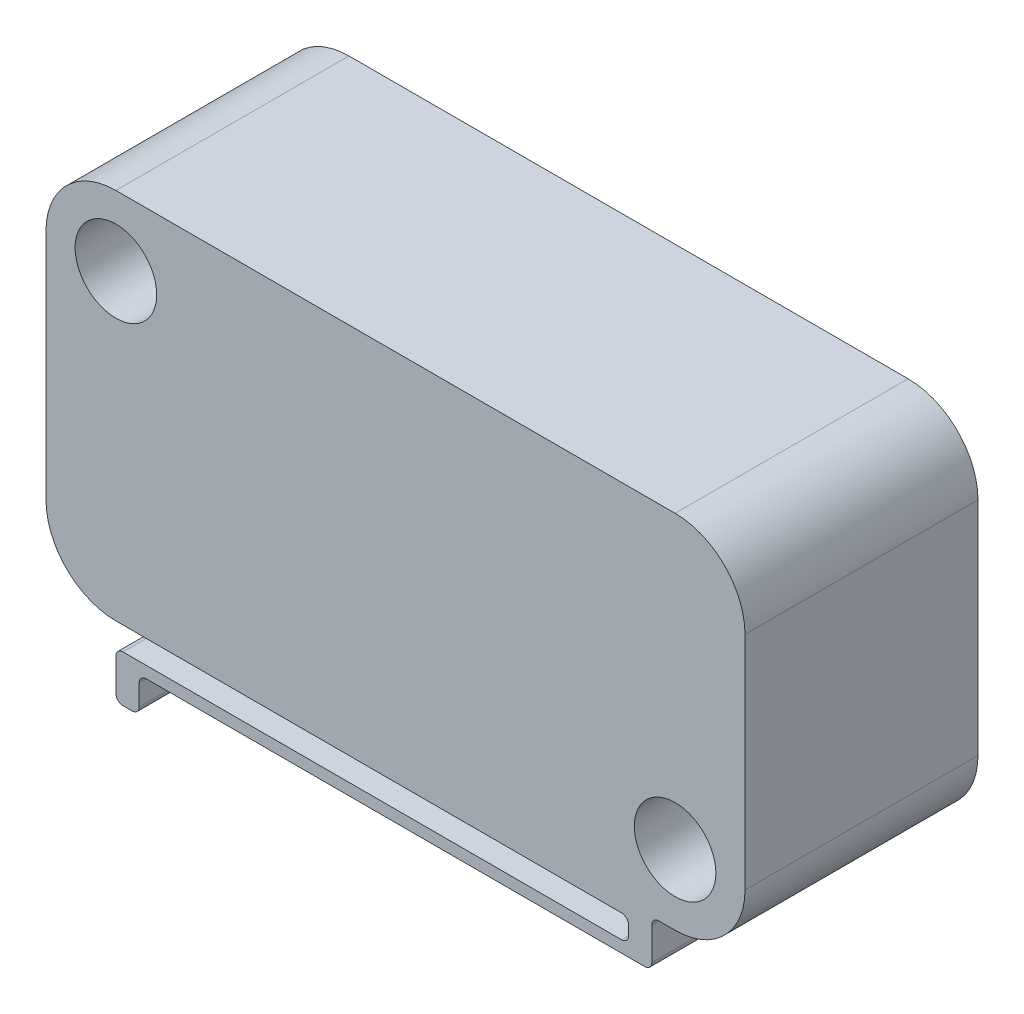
from build123d import *

# Parameters (mm, degrees)
ESQUISSE1_R          = 1.75
BASE_EXTRUSION_DEPTH = 10


with BuildPart() as part:
    # Esquisse1 → Base-Extrusion (new body)
    with BuildSketch(Plane.XY):
        with BuildLine():
            Line((3, 0), (24.7, 0))
            ThreePointArc((24.7, 0), (24.912132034, -0.087867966), (25, -0.3))
            Line((25, -0.3), (25, -0.7))
            ThreePointArc((25, -0.7), (24.912132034, -0.912132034), (24.7, -1))
            Line((24.7, -1), (3.3, -1))
            ThreePointArc((3.3, -1), (3.087867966, -1.087867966), (3, -1.3))
            Line((3, -1.3), (3, -2.7))
            ThreePointArc((3, -2.7), (3.087867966, -2.912132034), (3.3, -3))
            Line((3.3, -3), (3.7, -3))
            ThreePointArc((3.7, -3), (3.912132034, -2.912132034), (4, -2.7))
            Line((4, -2.7), (4, -1.8))
            ThreePointArc((4, -1.8), (4.087867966, -1.587867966), (4.3, -1.5))
            Line((4.3, -1.5), (25.7, -1.5))
            ThreePointArc((25.7, -1.5), (25.912132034, -1.412132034), (26, -1.2))
            Line((26, -1.2), (26, 0.2))
            ThreePointArc((26, 0.2), (26.087867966, 0.412132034), (26.3, 0.5))
            Line((26.3, 0.5), (27, 0.5))
            ThreePointArc((27, 0.5), (29.121320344, 1.378679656), (30, 3.5))
            Line((30, 3.5), (30, 13))
            ThreePointArc((30, 13), (29.121320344, 15.121320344), (27, 16))
            Line((27, 16), (3, 16))
            ThreePointArc((3, 16), (0.878679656, 15.121320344), (0, 13))
            Line((0, 13), (0, 3))
            ThreePointArc((0, 3), (0.878679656, 0.878679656), (3, 0))
        make_face()
        with Locations((3, 13)):
            Circle(ESQUISSE1_R, mode=Mode.SUBTRACT)
        with Locations((27, 3.5)):
            Circle(ESQUISSE1_R, mode=Mode.SUBTRACT)
    extrude(amount=BASE_EXTRUSION_DEPTH)


solid = part.part
